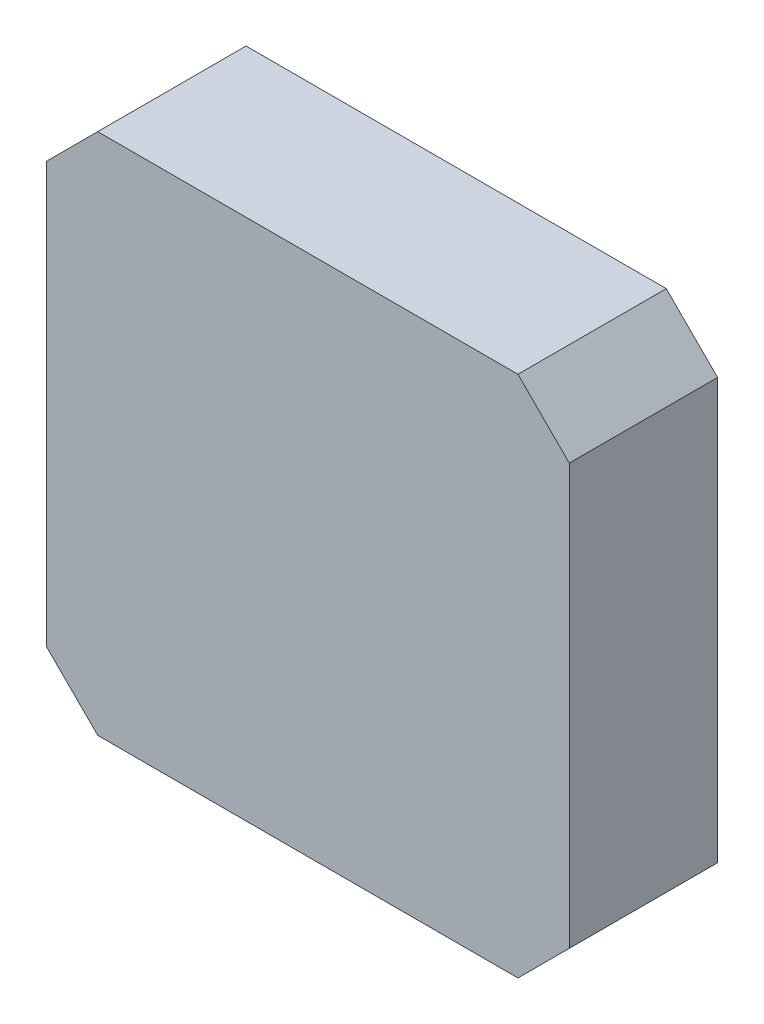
from build123d import *

# Parameters (mm, degrees)
SALIENTE_EXTRUIR1_DEPTH = 12
CROQUIS2_R              = 1.5
SALIENTE_EXTRUIR2_DEPTH = 3
REDONDEO1_R             = 1


with BuildPart() as part:
    # Croquis1 → Saliente-Extruir1 (new body)
    with BuildSketch(Plane.XY):
        Polygon((21.15, -17), (17, -21.15), (-17, -21.15), (-21.15, -17), (-21.15, 17), (-17, 21.15), (17, 21.15), (21.15, 17), align=None)
    extrude(amount=SALIENTE_EXTRUIR1_DEPTH)

    # Croquis2 → Saliente-Extruir2 (add)
    with BuildSketch(Plane(origin=(0, 0, 0), x_dir=(-1, 0, 0), z_dir=(0, 0, -1))):
        with Locations(Location((15.5, 15.5, 0), (0, 0, 180))):
            Circle(CROQUIS2_R)
        with Locations(Location((15.5, -15.5, 0), (0, 0, 180))):
            Circle(CROQUIS2_R)
        with Locations(Location((0, 0, 0), (0, 0, 180))):
            Circle(CROQUIS2_R)
        with Locations(Location((-15.5, 15.5, 0), (0, 0, 180))):
            Circle(CROQUIS2_R)
        with Locations(Location((-15.5, -15.5, 0), (0, 0, 180))):
            Circle(CROQUIS2_R)
    extrude(amount=SALIENTE_EXTRUIR2_DEPTH)

    # Redondeo1
    redondeo1_edges = [part.edges().sort_by_distance(p)[0] for p in [
        (-17, 15.5, -3),
        (-17, -15.5, -3),
        (-1.5, 0, -3),
        (14, 15.5, -3),
        (14, -15.5, -3),
    ]]
    fillet(redondeo1_edges, radius=REDONDEO1_R)


solid = part.part
